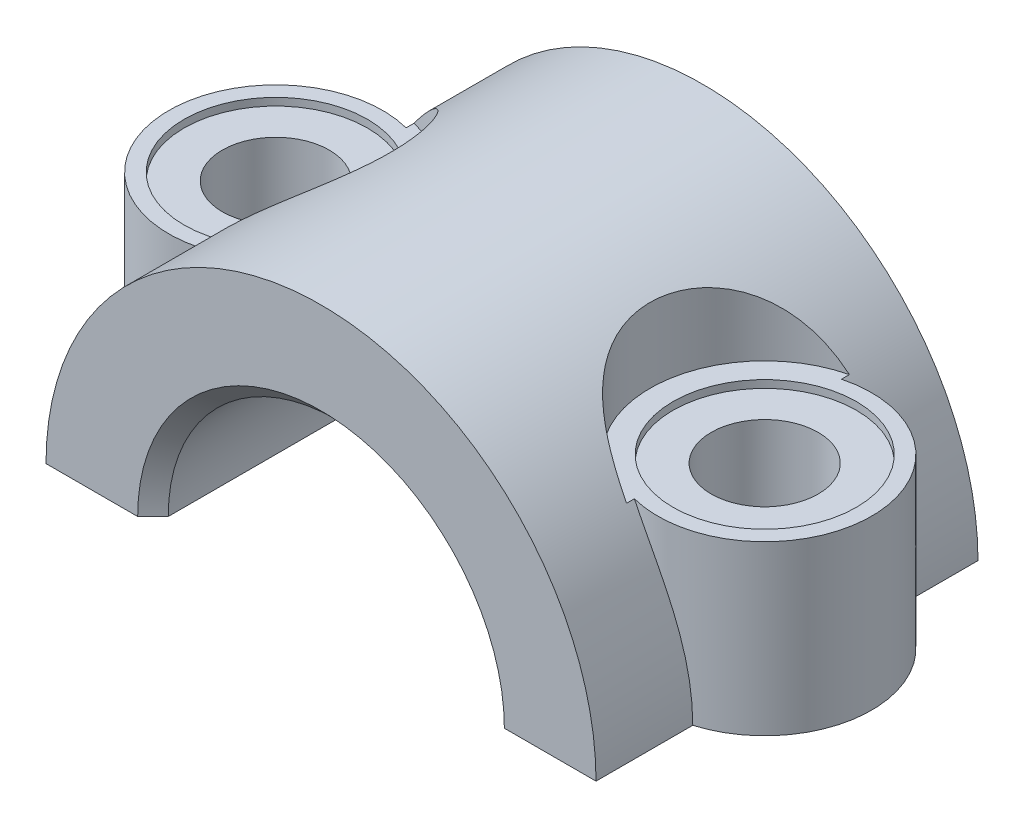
ISO-10303-21;
HEADER;
FILE_DESCRIPTION(('STEP AP214'),'2;1');
FILE_NAME('part.step','',(''),(''),'','','');
FILE_SCHEMA(('AUTOMOTIVE_DESIGN { 1 0 10303 214 1 1 1 1 }'));
ENDSEC;
DATA;
#1=APPLICATION_CONTEXT('core data for automotive mechanical design processes');
#2=APPLICATION_PROTOCOL_DEFINITION('international standard','automotive_design',2000,#1);
#3=PRODUCT_CONTEXT('',#1,'mechanical');
#4=PRODUCT('Part','Part','',(#3));
#5=PRODUCT_RELATED_PRODUCT_CATEGORY('part','',(#4));
#6=PRODUCT_DEFINITION_FORMATION('','',#4);
#7=PRODUCT_DEFINITION_CONTEXT('part definition',#1,'design');
#8=PRODUCT_DEFINITION('design','',#6,#7);
#9=PRODUCT_DEFINITION_SHAPE('','',#8);
#10=(LENGTH_UNIT() NAMED_UNIT(*) SI_UNIT(.MILLI.,.METRE.));
#11=(NAMED_UNIT(*) PLANE_ANGLE_UNIT() SI_UNIT($,.RADIAN.));
#12=(NAMED_UNIT(*) SI_UNIT($,.STERADIAN.) SOLID_ANGLE_UNIT());
#13=UNCERTAINTY_MEASURE_WITH_UNIT(LENGTH_MEASURE(1.E-05),#10,'distance_accuracy_value','');
#14=(GEOMETRIC_REPRESENTATION_CONTEXT(3) GLOBAL_UNCERTAINTY_ASSIGNED_CONTEXT((#13)) GLOBAL_UNIT_ASSIGNED_CONTEXT((#10,
#11,#12)) REPRESENTATION_CONTEXT('',''));
#15=CARTESIAN_POINT('',(0.,0.,0.));
#16=DIRECTION('',(0.,0.,1.));
#17=DIRECTION('',(1.,0.,0.));
#18=AXIS2_PLACEMENT_3D('',#15,#16,#17);
#19=CARTESIAN_POINT('',(-57.15,0.,79.375));
#20=DIRECTION('',(0.,1.,0.));
#21=DIRECTION('',(0.,0.,1.));
#22=AXIS2_PLACEMENT_3D('',#19,#20,#21);
#23=PLANE('',#22);
#24=CARTESIAN_POINT('',(-50.8,0.,37.973));
#25=DIRECTION('',(0.,-1.,0.));
#26=DIRECTION('',(0.,0.,-1.));
#27=AXIS2_PLACEMENT_3D('',#24,#25,#26);
#28=CIRCLE('',#27,11.1125);
#29=CARTESIAN_POINT('',(-50.8,0.,26.8605));
#30=VERTEX_POINT('',#29);
#31=EDGE_CURVE('E141',#30,#30,#28,.T.);
#32=ORIENTED_EDGE('',*,*,#31,.F.);
#33=EDGE_LOOP('',(#32));
#34=FACE_BOUND('',#33,.T.);
#35=DIRECTION('',(1.,0.,0.));
#36=VECTOR('',#35,1.);
#37=CARTESIAN_POINT('',(-57.15,0.,0.));
#38=LINE('',#37,#36);
#39=CARTESIAN_POINT('',(-57.15,0.,0.));
#40=VERTEX_POINT('',#39);
#41=CARTESIAN_POINT('',(-38.0999999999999,0.,0.));
#42=VERTEX_POINT('',#41);
#43=EDGE_CURVE('E248',#40,#42,#38,.T.);
#44=ORIENTED_EDGE('',*,*,#43,.T.);
#45=DIRECTION('',(0.707106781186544,0.,0.707106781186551));
#46=VECTOR('',#45,1.);
#47=CARTESIAN_POINT('',(0.,0.,38.1000000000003));
#48=LINE('',#47,#46);
#49=CARTESIAN_POINT('',(-34.925,0.,3.17499999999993));
#50=VERTEX_POINT('',#49);
#51=EDGE_CURVE('E250',#42,#50,#48,.T.);
#52=ORIENTED_EDGE('',*,*,#51,.T.);
#53=DIRECTION('',(0.,0.,1.));
#54=VECTOR('',#53,1.);
#55=CARTESIAN_POINT('',(-34.925,0.,0.));
#56=LINE('',#55,#54);
#57=CARTESIAN_POINT('',(-34.925,0.,76.2));
#58=VERTEX_POINT('',#57);
#59=EDGE_CURVE('E289',#50,#58,#56,.T.);
#60=ORIENTED_EDGE('',*,*,#59,.T.);
#61=DIRECTION('',(-0.707106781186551,0.,0.707106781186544));
#62=VECTOR('',#61,1.);
#63=CARTESIAN_POINT('',(0.,0.,41.2750000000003));
#64=LINE('',#63,#62);
#65=CARTESIAN_POINT('',(-38.1000000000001,0.,79.375));
#66=VERTEX_POINT('',#65);
#67=EDGE_CURVE('E149',#58,#66,#64,.T.);
#68=ORIENTED_EDGE('',*,*,#67,.T.);
#69=DIRECTION('',(1.,0.,0.));
#70=VECTOR('',#69,1.);
#71=CARTESIAN_POINT('',(-57.15,0.,79.375));
#72=LINE('',#71,#70);
#73=CARTESIAN_POINT('',(-57.15,0.,79.375));
#74=VERTEX_POINT('',#73);
#75=EDGE_CURVE('E269',#74,#66,#72,.T.);
#76=ORIENTED_EDGE('',*,*,#75,.F.);
#77=DIRECTION('',(0.,0.,-1.));
#78=VECTOR('',#77,1.);
#79=CARTESIAN_POINT('',(-57.15,0.,79.375));
#80=LINE('',#79,#78);
#81=CARTESIAN_POINT('',(-57.15,0.,59.2715474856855));
#82=VERTEX_POINT('',#81);
#83=EDGE_CURVE('E151',#74,#82,#80,.T.);
#84=ORIENTED_EDGE('',*,*,#83,.T.);
#85=CARTESIAN_POINT('',(-50.8,0.,37.973));
#86=DIRECTION('',(0.,-1.,0.));
#87=DIRECTION('',(0.,0.,-1.));
#88=AXIS2_PLACEMENT_3D('',#85,#86,#87);
#89=CIRCLE('',#88,22.225);
#90=CARTESIAN_POINT('',(-57.15,0.,16.6744525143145));
#91=VERTEX_POINT('',#90);
#92=EDGE_CURVE('E204',#82,#91,#89,.T.);
#93=ORIENTED_EDGE('',*,*,#92,.T.);
#94=EDGE_CURVE('E252',#91,#40,#80,.T.);
#95=ORIENTED_EDGE('',*,*,#94,.T.);
#96=EDGE_LOOP('',(#44,#52,#60,#68,#76,#84,#93,#95));
#97=FACE_BOUND('',#96,.T.);
#98=ADVANCED_FACE('F35',(#34,#97),#23,.F.);
#99=CARTESIAN_POINT('',(50.8,0.,37.973));
#100=DIRECTION('',(0.,-1.,0.));
#101=DIRECTION('',(0.,0.,-1.));
#102=AXIS2_PLACEMENT_3D('',#99,#100,#101);
#103=CYLINDRICAL_SURFACE('',#102,11.1125);
#104=CARTESIAN_POINT('',(50.8,0.,37.973));
#105=DIRECTION('',(0.,-1.,0.));
#106=DIRECTION('',(0.,0.,-1.));
#107=AXIS2_PLACEMENT_3D('',#104,#105,#106);
#108=CIRCLE('',#107,11.1125);
#109=CARTESIAN_POINT('',(50.8,0.,26.8605));
#110=VERTEX_POINT('',#109);
#111=EDGE_CURVE('E306',#110,#110,#108,.T.);
#112=ORIENTED_EDGE('',*,*,#111,.T.);
#113=EDGE_LOOP('',(#112));
#114=FACE_BOUND('',#113,.T.);
#115=CARTESIAN_POINT('',(50.8,33.3502,37.973));
#116=DIRECTION('',(0.,1.,0.));
#117=DIRECTION('',(0.,0.,1.));
#118=AXIS2_PLACEMENT_3D('',#115,#116,#117);
#119=CIRCLE('',#118,11.1125);
#120=CARTESIAN_POINT('',(50.8,33.3502,49.0855));
#121=VERTEX_POINT('',#120);
#122=EDGE_CURVE('E297',#121,#121,#119,.F.);
#123=ORIENTED_EDGE('',*,*,#122,.F.);
#124=EDGE_LOOP('',(#123));
#125=FACE_BOUND('',#124,.T.);
#126=ADVANCED_FACE('F237',(#114,#125),#103,.F.);
#127=CARTESIAN_POINT('',(-50.8,0.,37.973));
#128=DIRECTION('',(0.,-1.,0.));
#129=DIRECTION('',(0.,0.,-1.));
#130=AXIS2_PLACEMENT_3D('',#127,#128,#129);
#131=CYLINDRICAL_SURFACE('',#130,11.1125);
#132=ORIENTED_EDGE('',*,*,#31,.T.);
#133=EDGE_LOOP('',(#132));
#134=FACE_BOUND('',#133,.T.);
#135=CARTESIAN_POINT('',(-50.8,33.3502,37.973));
#136=DIRECTION('',(0.,1.,0.));
#137=DIRECTION('',(0.,0.,1.));
#138=AXIS2_PLACEMENT_3D('',#135,#136,#137);
#139=CIRCLE('',#138,11.1125);
#140=CARTESIAN_POINT('',(-50.8,33.3502,49.0855));
#141=VERTEX_POINT('',#140);
#142=EDGE_CURVE('E164',#141,#141,#139,.F.);
#143=ORIENTED_EDGE('',*,*,#142,.F.);
#144=EDGE_LOOP('',(#143));
#145=FACE_BOUND('',#144,.T.);
#146=ADVANCED_FACE('F173',(#134,#145),#131,.F.);
#147=CARTESIAN_POINT('',(0.,0.,79.375));
#148=DIRECTION('',(0.,0.,-1.));
#149=DIRECTION('',(-1.,0.,0.));
#150=AXIS2_PLACEMENT_3D('',#147,#148,#149);
#151=CYLINDRICAL_SURFACE('',#150,57.15);
#152=DIRECTION('',(0.,0.,-1.));
#153=VECTOR('',#152,1.);
#154=CARTESIAN_POINT('',(-45.2367867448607,34.925,79.375));
#155=LINE('',#154,#153);
#156=CARTESIAN_POINT('',(-45.2367867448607,34.925,14.8064117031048));
#157=VERTEX_POINT('',#156);
#158=CARTESIAN_POINT('',(-45.2367867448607,34.925,16.4555353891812));
#159=VERTEX_POINT('',#158);
#160=EDGE_CURVE('E136',#157,#159,#155,.F.);
#161=ORIENTED_EDGE('',*,*,#160,.F.);
#162=CARTESIAN_POINT('',(-45.2367867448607,34.925,61.1395882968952));
#163=CARTESIAN_POINT('',(-44.9313011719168,35.3207090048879,61.0662218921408));
#164=CARTESIAN_POINT('',(-44.6212395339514,35.7115582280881,60.9853791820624));
#165=CARTESIAN_POINT('',(-43.9928141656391,36.4828978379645,60.8073853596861));
#166=CARTESIAN_POINT('',(-43.6744482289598,36.8633854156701,60.7102298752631));
#167=CARTESIAN_POINT('',(-43.0294723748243,37.6142632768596,60.4979777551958));
#168=CARTESIAN_POINT('',(-42.7028407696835,37.9846201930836,60.382828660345));
#169=CARTESIAN_POINT('',(-42.0434348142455,38.7132205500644,60.1334820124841));
#170=CARTESIAN_POINT('',(-41.7106609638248,39.0714649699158,59.9992860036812));
#171=CARTESIAN_POINT('',(-41.0382934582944,39.7771276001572,59.7096972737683));
#172=CARTESIAN_POINT('',(-40.6986710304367,40.1244688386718,59.554183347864));
#173=CARTESIAN_POINT('',(-40.0161388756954,40.8051886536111,59.2213561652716));
#174=CARTESIAN_POINT('',(-39.6732293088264,41.1385679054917,59.0440439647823));
#175=CARTESIAN_POINT('',(-38.9863409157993,41.7900882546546,58.6667414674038));
#176=CARTESIAN_POINT('',(-38.6423640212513,42.1082483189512,58.4667805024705));
#177=CARTESIAN_POINT('',(-37.9549871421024,42.7288649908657,58.0430971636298));
#178=CARTESIAN_POINT('',(-37.6115870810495,43.0313238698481,57.8193782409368));
#179=CARTESIAN_POINT('',(-36.8236033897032,43.7091571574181,57.2756907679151));
#180=CARTESIAN_POINT('',(-36.3799556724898,44.078787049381,56.947122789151));
#181=CARTESIAN_POINT('',(-35.5027137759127,44.7883712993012,56.2472447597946));
#182=CARTESIAN_POINT('',(-35.0691195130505,45.1283259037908,55.8759350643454));
#183=CARTESIAN_POINT('',(-34.2192790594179,45.7760624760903,55.0917873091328));
#184=CARTESIAN_POINT('',(-33.8029770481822,46.0839537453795,54.6791004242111));
#185=CARTESIAN_POINT('',(-32.9921001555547,46.6679069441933,53.8119140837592));
#186=CARTESIAN_POINT('',(-32.597525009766,46.9439692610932,53.3574151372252));
#187=CARTESIAN_POINT('',(-31.8337767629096,47.4652324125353,52.4055012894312));
#188=CARTESIAN_POINT('',(-31.464771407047,47.7102368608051,51.907843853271));
#189=CARTESIAN_POINT('',(-30.7606483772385,48.1672220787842,50.8747552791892));
#190=CARTESIAN_POINT('',(-30.4255316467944,48.379201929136,50.3393230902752));
#191=CARTESIAN_POINT('',(-29.7942930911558,48.7704903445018,49.2338163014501));
#192=CARTESIAN_POINT('',(-29.4982098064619,48.9497666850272,48.663708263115));
#193=CARTESIAN_POINT('',(-28.9502291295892,49.2758409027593,47.4937587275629));
#194=CARTESIAN_POINT('',(-28.6983284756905,49.4226411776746,46.8939194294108));
#195=CARTESIAN_POINT('',(-28.2614303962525,49.6736571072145,45.7197841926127));
#196=CARTESIAN_POINT('',(-28.0726394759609,49.7803784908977,45.1474304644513));
#197=CARTESIAN_POINT('',(-27.738168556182,49.9675222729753,43.9860832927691));
#198=CARTESIAN_POINT('',(-27.5924861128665,50.0479461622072,43.3970907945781));
#199=CARTESIAN_POINT('',(-27.3461823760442,50.1829507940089,42.2071058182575));
#200=CARTESIAN_POINT('',(-27.2455427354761,50.237542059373,41.6061183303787));
#201=CARTESIAN_POINT('',(-27.0905323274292,50.3213011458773,40.3964499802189));
#202=CARTESIAN_POINT('',(-27.0361612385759,50.3504691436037,39.7877691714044));
#203=CARTESIAN_POINT('',(-26.9753138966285,50.3830930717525,38.5858348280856));
#204=CARTESIAN_POINT('',(-26.9674378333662,50.3873005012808,37.9926719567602));
#205=CARTESIAN_POINT('',(-26.9959353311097,50.3720383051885,36.807726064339));
#206=CARTESIAN_POINT('',(-27.0323077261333,50.3525693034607,36.2159430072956));
#207=CARTESIAN_POINT('',(-27.1488621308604,50.2898215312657,35.0380245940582));
#208=CARTESIAN_POINT('',(-27.2290410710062,50.2465444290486,34.4518888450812));
#209=CARTESIAN_POINT('',(-27.4322402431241,50.1358958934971,33.2893985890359));
#210=CARTESIAN_POINT('',(-27.5552606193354,50.0685243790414,32.7130441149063));
#211=CARTESIAN_POINT('',(-27.8422114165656,49.9095236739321,31.5758965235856));
#212=CARTESIAN_POINT('',(-28.0060186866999,49.8179674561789,31.0150621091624));
#213=CARTESIAN_POINT('',(-28.3727059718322,49.6100437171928,29.9110551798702));
#214=CARTESIAN_POINT('',(-28.5755856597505,49.4936764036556,29.3678825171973));
#215=CARTESIAN_POINT('',(-29.0178876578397,49.2356598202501,28.3028273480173));
#216=CARTESIAN_POINT('',(-29.2573110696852,49.0940097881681,27.78094548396));
#217=CARTESIAN_POINT('',(-29.7696649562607,48.7850283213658,26.7618246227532));
#218=CARTESIAN_POINT('',(-30.0425957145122,48.6176966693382,26.2645858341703));
#219=CARTESIAN_POINT('',(-30.6222380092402,48.2547347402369,25.2913990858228));
#220=CARTESIAN_POINT('',(-30.9293428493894,48.0587646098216,24.8158122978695));
#221=CARTESIAN_POINT('',(-31.5703707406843,47.6401162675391,23.8954998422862));
#222=CARTESIAN_POINT('',(-31.9042938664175,47.4174379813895,23.4507742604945));
#223=CARTESIAN_POINT('',(-32.5945022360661,46.9456655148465,22.594368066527));
#224=CARTESIAN_POINT('',(-32.9507758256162,46.6965850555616,22.1826704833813));
#225=CARTESIAN_POINT('',(-33.6814217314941,46.1723561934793,21.3933833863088));
#226=CARTESIAN_POINT('',(-34.0557944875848,45.8972071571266,21.0157947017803));
#227=CARTESIAN_POINT('',(-34.8393288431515,45.3056034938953,20.2754436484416));
#228=CARTESIAN_POINT('',(-35.2492689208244,44.9877053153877,19.9146599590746));
#229=CARTESIAN_POINT('',(-36.0793254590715,44.3247889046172,19.2318478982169));
#230=CARTESIAN_POINT('',(-36.4994424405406,43.9797692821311,18.9098215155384));
#231=CARTESIAN_POINT('',(-37.3460569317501,43.2631801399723,18.3031394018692));
#232=CARTESIAN_POINT('',(-37.7725667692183,42.8915520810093,18.0185702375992));
#233=CARTESIAN_POINT('',(-38.6266556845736,42.1240277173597,17.4863438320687));
#234=CARTESIAN_POINT('',(-39.0542347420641,41.7281318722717,17.2386858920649));
#235=CARTESIAN_POINT('',(-39.981819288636,40.8418559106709,16.7378459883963));
#236=CARTESIAN_POINT('',(-40.481301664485,40.3471244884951,16.4913898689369));
#237=CARTESIAN_POINT('',(-41.471244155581,39.3289085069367,16.0433424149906));
#238=CARTESIAN_POINT('',(-41.9617005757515,38.8054125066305,15.8417690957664));
#239=CARTESIAN_POINT('',(-42.9264905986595,37.7353283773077,15.4805144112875));
#240=CARTESIAN_POINT('',(-43.4008966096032,37.188879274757,15.3206140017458));
#241=CARTESIAN_POINT('',(-44.0996002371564,36.3521638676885,15.1080924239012));
#242=CARTESIAN_POINT('',(-44.3302543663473,36.0705428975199,15.0418293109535));
#243=CARTESIAN_POINT('',(-44.7870071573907,35.5018239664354,14.9178481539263));
#244=CARTESIAN_POINT('',(-45.0131062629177,35.2147265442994,14.8601292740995));
#245=CARTESIAN_POINT('',(-45.2367867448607,34.925,14.8064117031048));
#246=B_SPLINE_CURVE_WITH_KNOTS('',3,(#162,#163,#164,#165,#166,#167,#168,#169,#170,#171,#172,
#173,#174,#175,#176,#177,#178,#179,#180,#181,#182,#183,#184,#185,#186,#187,#188,#189,#190,#191,
#192,#193,#194,#195,#196,#197,#198,#199,#200,#201,#202,#203,#204,#205,#206,#207,#208,#209,#210,
#211,#212,#213,#214,#215,#216,#217,#218,#219,#220,#221,#222,#223,#224,#225,#226,#227,#228,#229,
#230,#231,#232,#233,#234,#235,#236,#237,#238,#239,#240,#241,#242,#243,#244,#245),.UNSPECIFIED.,
.F.,.F.,(4,2,2,2,2,2,2,2,2,2,2,2,2,2,2,2,2,2,2,2,2,2,2,2,2,2,2,2,2,2,2,2,2,2,2,2,2,2,2,2,2,4),
(0.,1.51575579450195,3.0319184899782,4.55258689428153,6.07313208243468,7.60271173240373,
9.1322172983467,10.6597642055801,12.1870895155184,14.1781541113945,16.1692021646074,
18.1532239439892,20.1372215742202,22.1331974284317,24.1292288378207,26.1272165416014,
28.1250566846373,29.9589794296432,31.7927981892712,33.6258693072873,35.458927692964,
37.2365054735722,39.014036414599,40.7914428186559,42.5688552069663,44.3409646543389,
46.1130592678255,47.8852073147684,49.6573703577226,51.4525900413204,53.247814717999,
55.0421109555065,56.8364508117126,58.7301470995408,60.6239405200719,62.5220365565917,
64.4200966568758,66.6528335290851,68.8864649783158,71.1081076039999,72.2179771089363,
73.3277379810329),.UNSPECIFIED.);
#247=CARTESIAN_POINT('',(-45.2367867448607,34.925,61.1395882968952));
#248=VERTEX_POINT('',#247);
#249=EDGE_CURVE('E140',#248,#157,#246,.T.);
#250=ORIENTED_EDGE('',*,*,#249,.F.);
#251=CARTESIAN_POINT('',(-45.2367867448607,34.925,59.4904646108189));
#252=VERTEX_POINT('',#251);
#253=EDGE_CURVE('E125',#252,#248,#155,.F.);
#254=ORIENTED_EDGE('',*,*,#253,.F.);
#255=CARTESIAN_POINT('',(-45.2367867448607,34.925,59.4904646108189));
#256=CARTESIAN_POINT('',(-45.610002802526,34.4416331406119,59.5869290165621));
#257=CARTESIAN_POINT('',(-45.9765277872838,33.9508309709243,59.6713627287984));
#258=CARTESIAN_POINT('',(-46.6949557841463,32.9557167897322,59.8186850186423));
#259=CARTESIAN_POINT('',(-47.0468636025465,32.4514093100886,59.8815807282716));
#260=CARTESIAN_POINT('',(-47.7344313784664,31.4312653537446,59.9883052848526));
#261=CARTESIAN_POINT('',(-48.0701201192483,30.9154518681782,60.0321691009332));
#262=CARTESIAN_POINT('',(-48.7251516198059,29.8724200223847,60.1033894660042));
#263=CARTESIAN_POINT('',(-49.0444929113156,29.3452006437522,60.1307445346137));
#264=CARTESIAN_POINT('',(-49.9764045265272,27.7488414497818,60.1914630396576));
#265=CARTESIAN_POINT('',(-50.5635879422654,26.6639246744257,60.2035821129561));
#266=CARTESIAN_POINT('',(-51.6666422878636,24.458184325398,60.1879498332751));
#267=CARTESIAN_POINT('',(-52.1824701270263,23.3373395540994,60.1601745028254));
#268=CARTESIAN_POINT('',(-52.9727297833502,21.4628783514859,60.0937431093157));
#269=CARTESIAN_POINT('',(-53.2684988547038,20.7179044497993,60.0622882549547));
#270=CARTESIAN_POINT('',(-53.8283784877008,19.2164023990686,59.9925185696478));
#271=CARTESIAN_POINT('',(-54.0924873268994,18.4598736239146,59.9542033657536));
#272=CARTESIAN_POINT('',(-54.5886654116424,16.9364120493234,59.874136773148));
#273=CARTESIAN_POINT('',(-54.8207284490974,16.1694772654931,59.8323847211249));
#274=CARTESIAN_POINT('',(-55.2524006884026,14.626565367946,59.7485620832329));
#275=CARTESIAN_POINT('',(-55.4520107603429,13.8505884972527,59.7064915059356));
#276=CARTESIAN_POINT('',(-55.818205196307,12.2918873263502,59.6248680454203));
#277=CARTESIAN_POINT('',(-55.9848349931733,11.5091738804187,59.5853117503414));
#278=CARTESIAN_POINT('',(-56.2851258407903,9.93717532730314,59.511058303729));
#279=CARTESIAN_POINT('',(-56.4187854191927,9.14788992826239,59.4763613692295));
#280=CARTESIAN_POINT('',(-56.6527922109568,7.56463030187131,59.4138513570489));
#281=CARTESIAN_POINT('',(-56.7531600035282,6.77065928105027,59.3860340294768));
#282=CARTESIAN_POINT('',(-56.9204718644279,5.17904439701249,59.3388148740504));
#283=CARTESIAN_POINT('',(-56.9874214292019,4.38140115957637,59.3194116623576));
#284=CARTESIAN_POINT('',(-57.0563295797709,3.28437615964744,59.2992585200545));
#285=CARTESIAN_POINT('',(-57.0727268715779,2.98591797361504,59.2944381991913));
#286=CARTESIAN_POINT('',(-57.1008358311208,2.38879874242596,59.2861489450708));
#287=CARTESIAN_POINT('',(-57.1125481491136,2.09013773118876,59.2826798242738));
#288=CARTESIAN_POINT('',(-57.1312763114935,1.49295767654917,59.2771231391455));
#289=CARTESIAN_POINT('',(-57.1382968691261,1.19443879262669,59.2750341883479));
#290=CARTESIAN_POINT('',(-57.1476591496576,0.597280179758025,59.2722453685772));
#291=CARTESIAN_POINT('',(-57.1500002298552,0.298640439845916,59.2715456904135));
#292=CARTESIAN_POINT('',(-57.15,0.,59.2715474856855));
#293=B_SPLINE_CURVE_WITH_KNOTS('',3,(#255,#256,#257,#258,#259,#260,#261,#262,#263,#264,#265,
#266,#267,#268,#269,#270,#271,#272,#273,#274,#275,#276,#277,#278,#279,#280,#281,#282,#283,#284,
#285,#286,#287,#288,#289,#290,#291,#292),.UNSPECIFIED.,.F.,.F.,(4,2,2,2,2,2,2,2,2,2,2,2,2,2,2,2,
2,2,4),(0.,1.85441641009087,3.70821815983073,5.5585991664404,7.40914607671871,11.1063467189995,
14.8057703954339,17.2115582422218,19.6174769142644,22.0238610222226,24.4301806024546,
26.8331618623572,29.2362504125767,31.6378507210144,34.039055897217,34.9358694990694,
35.8325585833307,36.7283455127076,37.6242554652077),.UNSPECIFIED.);
#294=EDGE_CURVE('E206',#252,#82,#293,.T.);
#295=ORIENTED_EDGE('',*,*,#294,.T.);
#296=ORIENTED_EDGE('',*,*,#83,.F.);
#297=CARTESIAN_POINT('',(0.,0.,79.375));
#298=DIRECTION('',(0.,0.,1.));
#299=DIRECTION('',(1.,0.,0.));
#300=AXIS2_PLACEMENT_3D('',#297,#298,#299);
#301=CIRCLE('',#300,57.15);
#302=CARTESIAN_POINT('',(57.15,0.,79.375));
#303=VERTEX_POINT('',#302);
#304=EDGE_CURVE('E255',#303,#74,#301,.T.);
#305=ORIENTED_EDGE('',*,*,#304,.F.);
#306=DIRECTION('',(0.,0.,-1.));
#307=VECTOR('',#306,1.);
#308=CARTESIAN_POINT('',(57.15,0.,79.375));
#309=LINE('',#308,#307);
#310=CARTESIAN_POINT('',(57.15,0.,59.2715474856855));
#311=VERTEX_POINT('',#310);
#312=EDGE_CURVE('E264',#303,#311,#309,.T.);
#313=ORIENTED_EDGE('',*,*,#312,.T.);
#314=CARTESIAN_POINT('',(57.15,0.,59.2715474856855));
#315=CARTESIAN_POINT('',(57.1500000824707,0.396081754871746,59.2715433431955));
#316=CARTESIAN_POINT('',(57.1458822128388,0.792150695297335,59.2727757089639));
#317=CARTESIAN_POINT('',(57.1294144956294,1.58409891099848,59.2776765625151));
#318=CARTESIAN_POINT('',(57.117064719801,1.97997818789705,59.2813450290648));
#319=CARTESIAN_POINT('',(57.0676766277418,3.16701620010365,59.2959482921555));
#320=CARTESIAN_POINT('',(57.0182995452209,3.95765488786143,59.3104809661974));
#321=CARTESIAN_POINT('',(56.8868034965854,5.53536893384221,59.3483618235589));
#322=CARTESIAN_POINT('',(56.8047088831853,6.3224465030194,59.3717034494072));
#323=CARTESIAN_POINT('',(56.6079533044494,7.89226613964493,59.4259419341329));
#324=CARTESIAN_POINT('',(56.4932921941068,8.67500818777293,59.456838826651));
#325=CARTESIAN_POINT('',(56.2352045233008,10.2135198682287,59.523555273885));
#326=CARTESIAN_POINT('',(56.0926483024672,10.9694426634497,59.5592174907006));
#327=CARTESIAN_POINT('',(55.7771859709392,12.4747502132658,59.6341292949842));
#328=CARTESIAN_POINT('',(55.6042797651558,13.2241349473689,59.6733788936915));
#329=CARTESIAN_POINT('',(55.2283228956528,14.7155176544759,59.7532092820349));
#330=CARTESIAN_POINT('',(55.0252614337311,15.4575128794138,59.7937905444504));
#331=CARTESIAN_POINT('',(54.5893337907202,16.9327713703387,59.8737003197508));
#332=CARTESIAN_POINT('',(54.3564673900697,17.6660345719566,59.9130288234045));
#333=CARTESIAN_POINT('',(53.8595235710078,19.1278416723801,59.9878476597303));
#334=CARTESIAN_POINT('',(53.595239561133,19.8563168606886,60.0233092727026));
#335=CARTESIAN_POINT('',(53.0371513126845,21.3021964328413,60.0869018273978));
#336=CARTESIAN_POINT('',(52.7433474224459,22.0196009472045,60.1150328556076));
#337=CARTESIAN_POINT('',(52.1268824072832,23.4416451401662,60.1605069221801));
#338=CARTESIAN_POINT('',(51.8042425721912,24.1462937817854,60.1778578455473));
#339=CARTESIAN_POINT('',(51.1304578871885,25.5421097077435,60.198099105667));
#340=CARTESIAN_POINT('',(50.7793115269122,26.2332762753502,60.2009886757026));
#341=CARTESIAN_POINT('',(50.0387817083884,27.6202525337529,60.1881348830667));
#342=CARTESIAN_POINT('',(49.6485908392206,28.3156276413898,60.1718551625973));
#343=CARTESIAN_POINT('',(48.8399660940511,29.6886321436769,60.115112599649));
#344=CARTESIAN_POINT('',(48.4215367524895,30.36626436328,60.0746536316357));
#345=CARTESIAN_POINT('',(47.556557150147,31.703820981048,59.9643920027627));
#346=CARTESIAN_POINT('',(47.109929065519,32.3636885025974,59.8945048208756));
#347=CARTESIAN_POINT('',(46.4212227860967,33.3369282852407,59.7636301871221));
#348=CARTESIAN_POINT('',(46.1884415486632,33.6586914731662,59.7156432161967));
#349=CARTESIAN_POINT('',(45.7169649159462,34.2963397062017,59.6102755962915));
#350=CARTESIAN_POINT('',(45.4782689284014,34.6122241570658,59.5528940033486));
#351=CARTESIAN_POINT('',(45.2367867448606,34.925,59.4904646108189));
#352=B_SPLINE_CURVE_WITH_KNOTS('',3,(#314,#315,#316,#317,#318,#319,#320,#321,#322,#323,#324,
#325,#326,#327,#328,#329,#330,#331,#332,#333,#334,#335,#336,#337,#338,#339,#340,#341,#342,#343,
#344,#345,#346,#347,#348,#349,#350,#351),.UNSPECIFIED.,.F.,.F.,(4,2,2,2,2,2,2,2,2,2,2,2,2,2,2,2,
2,2,4),(0.,1.18819642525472,2.37638249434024,4.75251552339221,7.12688321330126,9.50126147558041,
11.8108472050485,14.1204401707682,16.4308621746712,18.7413011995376,21.0678740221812,
23.3944193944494,25.7192610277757,28.0442259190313,30.4358199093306,32.8270307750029,
35.2251568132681,36.4250636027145,37.6250910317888),.UNSPECIFIED.);
#353=CARTESIAN_POINT('',(45.2367867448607,34.925,59.4904646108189));
#354=VERTEX_POINT('',#353);
#355=EDGE_CURVE('E198',#311,#354,#352,.T.);
#356=ORIENTED_EDGE('',*,*,#355,.T.);
#357=DIRECTION('',(0.,0.,-1.));
#358=VECTOR('',#357,1.);
#359=CARTESIAN_POINT('',(45.2367867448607,34.925,79.375));
#360=LINE('',#359,#358);
#361=CARTESIAN_POINT('',(45.2367867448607,34.925,61.1395882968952));
#362=VERTEX_POINT('',#361);
#363=EDGE_CURVE('E315',#362,#354,#360,.T.);
#364=ORIENTED_EDGE('',*,*,#363,.F.);
#365=CARTESIAN_POINT('',(45.2367867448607,34.925,14.8064117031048));
#366=CARTESIAN_POINT('',(44.9313011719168,35.3207090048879,14.8797781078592));
#367=CARTESIAN_POINT('',(44.6212395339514,35.7115582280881,14.9606208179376));
#368=CARTESIAN_POINT('',(43.9928141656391,36.4828978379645,15.1386146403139));
#369=CARTESIAN_POINT('',(43.6744482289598,36.8633854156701,15.2357701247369));
#370=CARTESIAN_POINT('',(43.0294723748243,37.6142632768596,15.4480222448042));
#371=CARTESIAN_POINT('',(42.7028407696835,37.9846201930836,15.563171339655));
#372=CARTESIAN_POINT('',(42.0434348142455,38.7132205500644,15.8125179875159));
#373=CARTESIAN_POINT('',(41.7106609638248,39.0714649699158,15.9467139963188));
#374=CARTESIAN_POINT('',(41.0382934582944,39.7771276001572,16.2363027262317));
#375=CARTESIAN_POINT('',(40.6986710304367,40.1244688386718,16.391816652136));
#376=CARTESIAN_POINT('',(40.0161388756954,40.8051886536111,16.7246438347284));
#377=CARTESIAN_POINT('',(39.6732293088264,41.1385679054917,16.9019560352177));
#378=CARTESIAN_POINT('',(38.9863409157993,41.7900882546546,17.2792585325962));
#379=CARTESIAN_POINT('',(38.6423640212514,42.1082483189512,17.4792194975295));
#380=CARTESIAN_POINT('',(37.9549871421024,42.7288649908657,17.9029028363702));
#381=CARTESIAN_POINT('',(37.6115870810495,43.0313238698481,18.1266217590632));
#382=CARTESIAN_POINT('',(36.8236033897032,43.7091571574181,18.6703092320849));
#383=CARTESIAN_POINT('',(36.3799556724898,44.078787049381,18.998877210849));
#384=CARTESIAN_POINT('',(35.5027137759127,44.7883712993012,19.6987552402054));
#385=CARTESIAN_POINT('',(35.0691195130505,45.1283259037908,20.0700649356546));
#386=CARTESIAN_POINT('',(34.2192790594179,45.7760624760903,20.8542126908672));
#387=CARTESIAN_POINT('',(33.8029770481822,46.0839537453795,21.2668995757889));
#388=CARTESIAN_POINT('',(32.9921001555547,46.6679069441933,22.1340859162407));
#389=CARTESIAN_POINT('',(32.597525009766,46.9439692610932,22.5885848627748));
#390=CARTESIAN_POINT('',(31.8337767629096,47.4652324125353,23.5404987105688));
#391=CARTESIAN_POINT('',(31.4647714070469,47.7102368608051,24.038156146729));
#392=CARTESIAN_POINT('',(30.7606483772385,48.1672220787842,25.0712447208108));
#393=CARTESIAN_POINT('',(30.4255316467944,48.379201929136,25.6066769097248));
#394=CARTESIAN_POINT('',(29.7942930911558,48.7704903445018,26.7121836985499));
#395=CARTESIAN_POINT('',(29.4982098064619,48.9497666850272,27.282291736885));
#396=CARTESIAN_POINT('',(28.9502291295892,49.2758409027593,28.452241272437));
#397=CARTESIAN_POINT('',(28.6983284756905,49.4226411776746,29.0520805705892));
#398=CARTESIAN_POINT('',(28.2614303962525,49.6736571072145,30.2262158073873));
#399=CARTESIAN_POINT('',(28.0726394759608,49.7803784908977,30.7985695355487));
#400=CARTESIAN_POINT('',(27.738168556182,49.9675222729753,31.9599167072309));
#401=CARTESIAN_POINT('',(27.5924861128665,50.0479461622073,32.5489092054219));
#402=CARTESIAN_POINT('',(27.3461823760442,50.1829507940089,33.7388941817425));
#403=CARTESIAN_POINT('',(27.2455427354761,50.237542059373,34.3398816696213));
#404=CARTESIAN_POINT('',(27.0905323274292,50.3213011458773,35.5495500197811));
#405=CARTESIAN_POINT('',(27.0361612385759,50.3504691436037,36.1582308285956));
#406=CARTESIAN_POINT('',(26.9753138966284,50.3830930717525,37.3601651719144));
#407=CARTESIAN_POINT('',(26.9674378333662,50.3873005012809,37.9533280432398));
#408=CARTESIAN_POINT('',(26.9959353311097,50.3720383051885,39.138273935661));
#409=CARTESIAN_POINT('',(27.0323077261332,50.3525693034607,39.7300569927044));
#410=CARTESIAN_POINT('',(27.1488621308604,50.2898215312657,40.9079754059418));
#411=CARTESIAN_POINT('',(27.2290410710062,50.2465444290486,41.4941111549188));
#412=CARTESIAN_POINT('',(27.4322402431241,50.1358958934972,42.6566014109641));
#413=CARTESIAN_POINT('',(27.5552606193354,50.0685243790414,43.2329558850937));
#414=CARTESIAN_POINT('',(27.8422114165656,49.9095236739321,44.3701034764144));
#415=CARTESIAN_POINT('',(28.0060186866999,49.8179674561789,44.9309378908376));
#416=CARTESIAN_POINT('',(28.3727059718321,49.6100437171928,46.0349448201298));
#417=CARTESIAN_POINT('',(28.5755856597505,49.4936764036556,46.5781174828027));
#418=CARTESIAN_POINT('',(29.0178876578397,49.2356598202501,47.6431726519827));
#419=CARTESIAN_POINT('',(29.2573110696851,49.0940097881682,48.16505451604));
#420=CARTESIAN_POINT('',(29.7696649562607,48.7850283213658,49.1841753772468));
#421=CARTESIAN_POINT('',(30.0425957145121,48.6176966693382,49.6814141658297));
#422=CARTESIAN_POINT('',(30.6222380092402,48.2547347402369,50.6546009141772));
#423=CARTESIAN_POINT('',(30.9293428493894,48.0587646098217,51.1301877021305));
#424=CARTESIAN_POINT('',(31.5703707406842,47.6401162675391,52.0505001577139));
#425=CARTESIAN_POINT('',(31.9042938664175,47.4174379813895,52.4952257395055));
#426=CARTESIAN_POINT('',(32.5945022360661,46.9456655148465,53.3516319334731));
#427=CARTESIAN_POINT('',(32.9507758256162,46.6965850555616,53.7633295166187));
#428=CARTESIAN_POINT('',(33.6814217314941,46.1723561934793,54.5526166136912));
#429=CARTESIAN_POINT('',(34.0557944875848,45.8972071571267,54.9302052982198));
#430=CARTESIAN_POINT('',(34.8393288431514,45.3056034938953,55.6705563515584));
#431=CARTESIAN_POINT('',(35.2492689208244,44.9877053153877,56.0313400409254));
#432=CARTESIAN_POINT('',(36.0793254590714,44.3247889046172,56.7141521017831));
#433=CARTESIAN_POINT('',(36.4994424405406,43.9797692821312,57.0361784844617));
#434=CARTESIAN_POINT('',(37.34605693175,43.2631801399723,57.6428605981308));
#435=CARTESIAN_POINT('',(37.7725667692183,42.8915520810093,57.9274297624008));
#436=CARTESIAN_POINT('',(38.6266556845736,42.1240277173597,58.4596561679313));
#437=CARTESIAN_POINT('',(39.054234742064,41.7281318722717,58.7073141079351));
#438=CARTESIAN_POINT('',(39.981819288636,40.8418559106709,59.2081540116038));
#439=CARTESIAN_POINT('',(40.4813016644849,40.3471244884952,59.4546101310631));
#440=CARTESIAN_POINT('',(41.471244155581,39.3289085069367,59.9026575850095));
#441=CARTESIAN_POINT('',(41.9617005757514,38.8054125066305,60.1042309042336));
#442=CARTESIAN_POINT('',(42.9264905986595,37.7353283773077,60.4654855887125));
#443=CARTESIAN_POINT('',(43.4008966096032,37.188879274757,60.6253859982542));
#444=CARTESIAN_POINT('',(44.0996002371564,36.3521638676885,60.8379075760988));
#445=CARTESIAN_POINT('',(44.3302543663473,36.0705428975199,60.9041706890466));
#446=CARTESIAN_POINT('',(44.7870071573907,35.5018239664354,61.0281518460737));
#447=CARTESIAN_POINT('',(45.0131062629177,35.2147265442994,61.0858707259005));
#448=CARTESIAN_POINT('',(45.2367867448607,34.925,61.1395882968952));
#449=B_SPLINE_CURVE_WITH_KNOTS('',3,(#365,#366,#367,#368,#369,#370,#371,#372,#373,#374,#375,
#376,#377,#378,#379,#380,#381,#382,#383,#384,#385,#386,#387,#388,#389,#390,#391,#392,#393,#394,
#395,#396,#397,#398,#399,#400,#401,#402,#403,#404,#405,#406,#407,#408,#409,#410,#411,#412,#413,
#414,#415,#416,#417,#418,#419,#420,#421,#422,#423,#424,#425,#426,#427,#428,#429,#430,#431,#432,
#433,#434,#435,#436,#437,#438,#439,#440,#441,#442,#443,#444,#445,#446,#447,#448),.UNSPECIFIED.,
.F.,.F.,(4,2,2,2,2,2,2,2,2,2,2,2,2,2,2,2,2,2,2,2,2,2,2,2,2,2,2,2,2,2,2,2,2,2,2,2,2,2,2,2,2,4),
(0.,1.51575579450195,3.03191848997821,4.55258689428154,6.0731320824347,7.60271173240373,
9.1322172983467,10.6597642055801,12.1870895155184,14.1781541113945,16.1692021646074,
18.1532239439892,20.1372215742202,22.1331974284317,24.1292288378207,26.1272165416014,
28.1250566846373,29.9589794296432,31.7927981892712,33.6258693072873,35.458927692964,
37.2365054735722,39.014036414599,40.7914428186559,42.5688552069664,44.3409646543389,
46.1130592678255,47.8852073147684,49.6573703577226,51.4525900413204,53.247814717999,
55.0421109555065,56.8364508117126,58.7301470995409,60.6239405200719,62.5220365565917,
64.4200966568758,66.6528335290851,68.8864649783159,71.108107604,72.2179771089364,
73.327737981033),.UNSPECIFIED.);
#450=CARTESIAN_POINT('',(45.2367867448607,34.925,14.8064117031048));
#451=VERTEX_POINT('',#450);
#452=EDGE_CURVE('E146',#451,#362,#449,.T.);
#453=ORIENTED_EDGE('',*,*,#452,.F.);
#454=CARTESIAN_POINT('',(45.2367867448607,34.925,16.4555353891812));
#455=VERTEX_POINT('',#454);
#456=EDGE_CURVE('E313',#455,#451,#360,.T.);
#457=ORIENTED_EDGE('',*,*,#456,.F.);
#458=CARTESIAN_POINT('',(45.2367867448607,34.925,16.4555353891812));
#459=CARTESIAN_POINT('',(45.610002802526,34.4416331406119,16.3590709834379));
#460=CARTESIAN_POINT('',(45.9765277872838,33.9508309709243,16.2746372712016));
#461=CARTESIAN_POINT('',(46.6949557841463,32.9557167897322,16.1273149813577));
#462=CARTESIAN_POINT('',(47.0468636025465,32.4514093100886,16.0644192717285));
#463=CARTESIAN_POINT('',(47.7344313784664,31.4312653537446,15.9576947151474));
#464=CARTESIAN_POINT('',(48.0701201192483,30.9154518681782,15.9138308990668));
#465=CARTESIAN_POINT('',(48.7251516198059,29.8724200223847,15.8426105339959));
#466=CARTESIAN_POINT('',(49.0444929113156,29.3452006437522,15.8152554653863));
#467=CARTESIAN_POINT('',(49.9764045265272,27.7488414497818,15.7545369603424));
#468=CARTESIAN_POINT('',(50.5635879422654,26.6639246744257,15.7424178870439));
#469=CARTESIAN_POINT('',(51.6666422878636,24.458184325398,15.7580501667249));
#470=CARTESIAN_POINT('',(52.1824701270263,23.3373395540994,15.7858254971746));
#471=CARTESIAN_POINT('',(52.9727297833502,21.4628783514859,15.8522568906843));
#472=CARTESIAN_POINT('',(53.2684988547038,20.7179044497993,15.8837117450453));
#473=CARTESIAN_POINT('',(53.8283784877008,19.2164023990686,15.9534814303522));
#474=CARTESIAN_POINT('',(54.0924873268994,18.4598736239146,15.9917966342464));
#475=CARTESIAN_POINT('',(54.5886654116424,16.9364120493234,16.071863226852));
#476=CARTESIAN_POINT('',(54.8207284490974,16.1694772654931,16.1136152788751));
#477=CARTESIAN_POINT('',(55.2524006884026,14.626565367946,16.1974379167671));
#478=CARTESIAN_POINT('',(55.4520107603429,13.8505884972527,16.2395084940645));
#479=CARTESIAN_POINT('',(55.818205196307,12.2918873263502,16.3211319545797));
#480=CARTESIAN_POINT('',(55.9848349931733,11.5091738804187,16.3606882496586));
#481=CARTESIAN_POINT('',(56.2851258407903,9.93717532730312,16.434941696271));
#482=CARTESIAN_POINT('',(56.4187854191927,9.14788992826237,16.4696386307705));
#483=CARTESIAN_POINT('',(56.6527922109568,7.56463030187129,16.5321486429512));
#484=CARTESIAN_POINT('',(56.7531600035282,6.77065928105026,16.5599659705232));
#485=CARTESIAN_POINT('',(56.9204718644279,5.17904439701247,16.6071851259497));
#486=CARTESIAN_POINT('',(56.9874214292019,4.38140115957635,16.6265883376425));
#487=CARTESIAN_POINT('',(57.0563295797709,3.28437615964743,16.6467414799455));
#488=CARTESIAN_POINT('',(57.0727268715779,2.98591797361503,16.6515618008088));
#489=CARTESIAN_POINT('',(57.1008358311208,2.38879874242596,16.6598510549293));
#490=CARTESIAN_POINT('',(57.1125481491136,2.09013773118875,16.6633201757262));
#491=CARTESIAN_POINT('',(57.1312763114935,1.49295767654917,16.6688768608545));
#492=CARTESIAN_POINT('',(57.1382968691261,1.19443879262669,16.6709658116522));
#493=CARTESIAN_POINT('',(57.1476591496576,0.597280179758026,16.6737546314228));
#494=CARTESIAN_POINT('',(57.1500002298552,0.298640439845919,16.6744543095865));
#495=CARTESIAN_POINT('',(57.15,0.,16.6744525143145));
#496=B_SPLINE_CURVE_WITH_KNOTS('',3,(#458,#459,#460,#461,#462,#463,#464,#465,#466,#467,#468,
#469,#470,#471,#472,#473,#474,#475,#476,#477,#478,#479,#480,#481,#482,#483,#484,#485,#486,#487,
#488,#489,#490,#491,#492,#493,#494,#495),.UNSPECIFIED.,.F.,.F.,(4,2,2,2,2,2,2,2,2,2,2,2,2,2,2,2,
2,2,4),(0.,1.85441641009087,3.70821815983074,5.5585991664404,7.40914607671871,11.1063467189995,
14.8057703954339,17.2115582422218,19.6174769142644,22.0238610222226,24.4301806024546,
26.8331618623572,29.2362504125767,31.6378507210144,34.039055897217,34.9358694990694,
35.8325585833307,36.7283455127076,37.6242554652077),.UNSPECIFIED.);
#497=CARTESIAN_POINT('',(57.15,0.,16.6744525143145));
#498=VERTEX_POINT('',#497);
#499=EDGE_CURVE('E192',#455,#498,#496,.T.);
#500=ORIENTED_EDGE('',*,*,#499,.T.);
#501=CARTESIAN_POINT('',(57.15,0.,0.));
#502=VERTEX_POINT('',#501);
#503=EDGE_CURVE('E265',#498,#502,#309,.T.);
#504=ORIENTED_EDGE('',*,*,#503,.T.);
#505=CARTESIAN_POINT('',(0.,0.,0.));
#506=DIRECTION('',(0.,0.,1.));
#507=DIRECTION('',(1.,0.,0.));
#508=AXIS2_PLACEMENT_3D('',#505,#506,#507);
#509=CIRCLE('',#508,57.15);
#510=EDGE_CURVE('E260',#502,#40,#509,.T.);
#511=ORIENTED_EDGE('',*,*,#510,.T.);
#512=ORIENTED_EDGE('',*,*,#94,.F.);
#513=CARTESIAN_POINT('',(-57.15,0.,16.6744525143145));
#514=CARTESIAN_POINT('',(-57.1500000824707,0.396081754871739,16.6744566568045));
#515=CARTESIAN_POINT('',(-57.1458822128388,0.792150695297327,16.6732242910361));
#516=CARTESIAN_POINT('',(-57.1294144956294,1.58409891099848,16.6683234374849));
#517=CARTESIAN_POINT('',(-57.117064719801,1.97997818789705,16.6646549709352));
#518=CARTESIAN_POINT('',(-57.0676766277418,3.16701620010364,16.6500517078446));
#519=CARTESIAN_POINT('',(-57.0182995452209,3.95765488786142,16.6355190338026));
#520=CARTESIAN_POINT('',(-56.8868034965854,5.5353689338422,16.5976381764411));
#521=CARTESIAN_POINT('',(-56.8047088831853,6.32244650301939,16.5742965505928));
#522=CARTESIAN_POINT('',(-56.6079533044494,7.89226613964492,16.5200580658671));
#523=CARTESIAN_POINT('',(-56.4932921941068,8.67500818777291,16.489161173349));
#524=CARTESIAN_POINT('',(-56.2352045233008,10.2135198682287,16.422444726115));
#525=CARTESIAN_POINT('',(-56.0926483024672,10.9694426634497,16.3867825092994));
#526=CARTESIAN_POINT('',(-55.7771859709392,12.4747502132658,16.3118707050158));
#527=CARTESIAN_POINT('',(-55.6042797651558,13.2241349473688,16.2726211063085));
#528=CARTESIAN_POINT('',(-55.2283228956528,14.7155176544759,16.1927907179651));
#529=CARTESIAN_POINT('',(-55.0252614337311,15.4575128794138,16.1522094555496));
#530=CARTESIAN_POINT('',(-54.5893337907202,16.9327713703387,16.0722996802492));
#531=CARTESIAN_POINT('',(-54.3564673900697,17.6660345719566,16.0329711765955));
#532=CARTESIAN_POINT('',(-53.8595235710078,19.1278416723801,15.9581523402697));
#533=CARTESIAN_POINT('',(-53.595239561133,19.8563168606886,15.9226907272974));
#534=CARTESIAN_POINT('',(-53.0371513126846,21.3021964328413,15.8590981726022));
#535=CARTESIAN_POINT('',(-52.7433474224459,22.0196009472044,15.8309671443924));
#536=CARTESIAN_POINT('',(-52.1268824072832,23.4416451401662,15.7854930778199));
#537=CARTESIAN_POINT('',(-51.8042425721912,24.1462937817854,15.7681421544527));
#538=CARTESIAN_POINT('',(-51.1304578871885,25.5421097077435,15.747900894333));
#539=CARTESIAN_POINT('',(-50.7793115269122,26.2332762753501,15.7450113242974));
#540=CARTESIAN_POINT('',(-50.0387817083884,27.6202525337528,15.7578651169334));
#541=CARTESIAN_POINT('',(-49.6485908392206,28.3156276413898,15.7741448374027));
#542=CARTESIAN_POINT('',(-48.8399660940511,29.6886321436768,15.830887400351));
#543=CARTESIAN_POINT('',(-48.4215367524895,30.36626436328,15.8713463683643));
#544=CARTESIAN_POINT('',(-47.556557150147,31.703820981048,15.9816079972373));
#545=CARTESIAN_POINT('',(-47.109929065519,32.3636885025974,16.0514951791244));
#546=CARTESIAN_POINT('',(-46.4212227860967,33.3369282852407,16.1823698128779));
#547=CARTESIAN_POINT('',(-46.1884415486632,33.6586914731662,16.2303567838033));
#548=CARTESIAN_POINT('',(-45.7169649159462,34.2963397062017,16.3357244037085));
#549=CARTESIAN_POINT('',(-45.4782689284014,34.6122241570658,16.3931059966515));
#550=CARTESIAN_POINT('',(-45.2367867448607,34.925,16.4555353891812));
#551=B_SPLINE_CURVE_WITH_KNOTS('',3,(#513,#514,#515,#516,#517,#518,#519,#520,#521,#522,#523,
#524,#525,#526,#527,#528,#529,#530,#531,#532,#533,#534,#535,#536,#537,#538,#539,#540,#541,#542,
#543,#544,#545,#546,#547,#548,#549,#550),.UNSPECIFIED.,.F.,.F.,(4,2,2,2,2,2,2,2,2,2,2,2,2,2,2,2,
2,2,4),(0.,1.18819642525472,2.37638249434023,4.75251552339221,7.12688321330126,9.5012614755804,
11.8108472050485,14.1204401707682,16.4308621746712,18.7413011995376,21.0678740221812,
23.3944193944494,25.7192610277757,28.0442259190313,30.4358199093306,32.8270307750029,
35.2251568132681,36.4250636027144,37.6250910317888),.UNSPECIFIED.);
#552=EDGE_CURVE('E212',#91,#159,#551,.T.);
#553=ORIENTED_EDGE('',*,*,#552,.T.);
#554=EDGE_LOOP('',(#161,#250,#254,#295,#296,#305,#313,#356,#364,#453,#457,#500,#504,#511,#512,#553));
#555=FACE_BOUND('',#554,.T.);
#556=ADVANCED_FACE('F143',(#555),#151,.T.);
#557=ORIENTED_EDGE('',*,*,#111,.F.);
#558=EDGE_LOOP('',(#557));
#559=FACE_BOUND('',#558,.T.);
#560=DIRECTION('',(0.,0.,1.));
#561=VECTOR('',#560,1.);
#562=CARTESIAN_POINT('',(34.925,0.,0.));
#563=LINE('',#562,#561);
#564=CARTESIAN_POINT('',(34.925,0.,76.2));
#565=VERTEX_POINT('',#564);
#566=CARTESIAN_POINT('',(34.925,0.,3.17499999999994));
#567=VERTEX_POINT('',#566);
#568=EDGE_CURVE('E286',#565,#567,#563,.F.);
#569=ORIENTED_EDGE('',*,*,#568,.T.);
#570=DIRECTION('',(0.707106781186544,0.,-0.707106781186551));
#571=VECTOR('',#570,1.);
#572=CARTESIAN_POINT('',(0.,0.,38.1000000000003));
#573=LINE('',#572,#571);
#574=CARTESIAN_POINT('',(38.0999999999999,0.,0.));
#575=VERTEX_POINT('',#574);
#576=EDGE_CURVE('E43',#567,#575,#573,.T.);
#577=ORIENTED_EDGE('',*,*,#576,.T.);
#578=EDGE_CURVE('E256',#575,#502,#38,.T.);
#579=ORIENTED_EDGE('',*,*,#578,.T.);
#580=ORIENTED_EDGE('',*,*,#503,.F.);
#581=CARTESIAN_POINT('',(50.8,0.,37.973));
#582=DIRECTION('',(0.,-1.,0.));
#583=DIRECTION('',(0.,0.,-1.));
#584=AXIS2_PLACEMENT_3D('',#581,#582,#583);
#585=CIRCLE('',#584,22.225);
#586=EDGE_CURVE('E318',#498,#311,#585,.T.);
#587=ORIENTED_EDGE('',*,*,#586,.T.);
#588=ORIENTED_EDGE('',*,*,#312,.F.);
#589=CARTESIAN_POINT('',(38.1000000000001,0.,79.375));
#590=VERTEX_POINT('',#589);
#591=EDGE_CURVE('E259',#590,#303,#72,.T.);
#592=ORIENTED_EDGE('',*,*,#591,.F.);
#593=DIRECTION('',(-0.707106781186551,0.,-0.707106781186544));
#594=VECTOR('',#593,1.);
#595=CARTESIAN_POINT('',(0.,0.,41.2750000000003));
#596=LINE('',#595,#594);
#597=EDGE_CURVE('E285',#590,#565,#596,.T.);
#598=ORIENTED_EDGE('',*,*,#597,.T.);
#599=EDGE_LOOP('',(#569,#577,#579,#580,#587,#588,#592,#598));
#600=FACE_BOUND('',#599,.T.);
#601=ADVANCED_FACE('F226',(#559,#600),#23,.F.);
#602=CARTESIAN_POINT('',(0.,0.,79.375));
#603=DIRECTION('',(0.,0.,1.));
#604=DIRECTION('',(1.,0.,0.));
#605=AXIS2_PLACEMENT_3D('',#602,#603,#604);
#606=PLANE('',#605);
#607=ORIENTED_EDGE('',*,*,#75,.T.);
#608=CARTESIAN_POINT('',(0.,0.,79.375));
#609=DIRECTION('',(0.,0.,1.));
#610=DIRECTION('',(1.,0.,0.));
#611=AXIS2_PLACEMENT_3D('',#608,#609,#610);
#612=CIRCLE('',#611,38.1000000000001);
#613=EDGE_CURVE('E11',#66,#590,#612,.F.);
#614=ORIENTED_EDGE('',*,*,#613,.T.);
#615=ORIENTED_EDGE('',*,*,#591,.T.);
#616=ORIENTED_EDGE('',*,*,#304,.T.);
#617=EDGE_LOOP('',(#607,#614,#615,#616));
#618=FACE_BOUND('',#617,.T.);
#619=ADVANCED_FACE('F221',(#618),#606,.T.);
#620=CARTESIAN_POINT('',(0.,0.,0.));
#621=DIRECTION('',(0.,0.,1.));
#622=DIRECTION('',(1.,0.,0.));
#623=AXIS2_PLACEMENT_3D('',#620,#621,#622);
#624=PLANE('',#623);
#625=ORIENTED_EDGE('',*,*,#578,.F.);
#626=CARTESIAN_POINT('',(0.,0.,0.));
#627=DIRECTION('',(0.,0.,1.));
#628=DIRECTION('',(1.,0.,0.));
#629=AXIS2_PLACEMENT_3D('',#626,#627,#628);
#630=CIRCLE('',#629,38.0999999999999);
#631=EDGE_CURVE('E145',#575,#42,#630,.T.);
#632=ORIENTED_EDGE('',*,*,#631,.T.);
#633=ORIENTED_EDGE('',*,*,#43,.F.);
#634=ORIENTED_EDGE('',*,*,#510,.F.);
#635=EDGE_LOOP('',(#625,#632,#633,#634));
#636=FACE_BOUND('',#635,.T.);
#637=ADVANCED_FACE('F225',(#636),#624,.F.);
#638=CARTESIAN_POINT('',(-50.8,34.925,37.973));
#639=DIRECTION('',(0.,-1.,0.));
#640=DIRECTION('',(0.,0.,-1.));
#641=AXIS2_PLACEMENT_3D('',#638,#639,#640);
#642=PLANE('',#641);
#643=CARTESIAN_POINT('',(-50.8,34.925,37.973));
#644=DIRECTION('',(0.,1.,0.));
#645=DIRECTION('',(0.,0.,1.));
#646=AXIS2_PLACEMENT_3D('',#643,#644,#645);
#647=CIRCLE('',#646,19.05);
#648=CARTESIAN_POINT('',(-50.8,34.925,57.023));
#649=VERTEX_POINT('',#648);
#650=EDGE_CURVE('E303',#649,#649,#647,.T.);
#651=ORIENTED_EDGE('',*,*,#650,.F.);
#652=EDGE_LOOP('',(#651));
#653=FACE_BOUND('',#652,.T.);
#654=CARTESIAN_POINT('',(-50.8,34.925,37.973));
#655=DIRECTION('',(0.,-1.,0.));
#656=DIRECTION('',(0.,0.,-1.));
#657=AXIS2_PLACEMENT_3D('',#654,#655,#656);
#658=CIRCLE('',#657,22.225);
#659=EDGE_CURVE('E131',#252,#159,#658,.T.);
#660=ORIENTED_EDGE('',*,*,#659,.F.);
#661=ORIENTED_EDGE('',*,*,#253,.T.);
#662=CARTESIAN_POINT('',(-50.8,34.925,37.973));
#663=DIRECTION('',(0.,1.,0.));
#664=DIRECTION('',(0.,0.,1.));
#665=AXIS2_PLACEMENT_3D('',#662,#663,#664);
#666=CIRCLE('',#665,23.8252);
#667=EDGE_CURVE('E128',#248,#157,#666,.T.);
#668=ORIENTED_EDGE('',*,*,#667,.T.);
#669=ORIENTED_EDGE('',*,*,#160,.T.);
#670=EDGE_LOOP('',(#660,#661,#668,#669));
#671=FACE_BOUND('',#670,.T.);
#672=ADVANCED_FACE('F127',(#653,#671),#642,.F.);
#673=CARTESIAN_POINT('',(-50.8,34.925,37.973));
#674=DIRECTION('',(0.,-1.,0.));
#675=DIRECTION('',(0.,0.,-1.));
#676=AXIS2_PLACEMENT_3D('',#673,#674,#675);
#677=CYLINDRICAL_SURFACE('',#676,22.225);
#678=ORIENTED_EDGE('',*,*,#552,.F.);
#679=ORIENTED_EDGE('',*,*,#92,.F.);
#680=ORIENTED_EDGE('',*,*,#294,.F.);
#681=ORIENTED_EDGE('',*,*,#659,.T.);
#682=EDGE_LOOP('',(#678,#679,#680,#681));
#683=FACE_BOUND('',#682,.T.);
#684=ADVANCED_FACE('F183',(#683),#677,.T.);
#685=CARTESIAN_POINT('',(50.8,34.925,37.973));
#686=DIRECTION('',(0.,-1.,0.));
#687=DIRECTION('',(0.,0.,-1.));
#688=AXIS2_PLACEMENT_3D('',#685,#686,#687);
#689=PLANE('',#688);
#690=CARTESIAN_POINT('',(50.8,34.925,37.973));
#691=DIRECTION('',(0.,1.,0.));
#692=DIRECTION('',(0.,0.,1.));
#693=AXIS2_PLACEMENT_3D('',#690,#691,#692);
#694=CIRCLE('',#693,19.05);
#695=CARTESIAN_POINT('',(50.8,34.925,57.023));
#696=VERTEX_POINT('',#695);
#697=EDGE_CURVE('E291',#696,#696,#694,.T.);
#698=ORIENTED_EDGE('',*,*,#697,.F.);
#699=EDGE_LOOP('',(#698));
#700=FACE_BOUND('',#699,.T.);
#701=CARTESIAN_POINT('',(50.8,34.925,37.973));
#702=DIRECTION('',(0.,-1.,0.));
#703=DIRECTION('',(0.,0.,-1.));
#704=AXIS2_PLACEMENT_3D('',#701,#702,#703);
#705=CIRCLE('',#704,22.225);
#706=EDGE_CURVE('E316',#455,#354,#705,.T.);
#707=ORIENTED_EDGE('',*,*,#706,.F.);
#708=ORIENTED_EDGE('',*,*,#456,.T.);
#709=CARTESIAN_POINT('',(50.8,34.925,37.973));
#710=DIRECTION('',(0.,1.,0.));
#711=DIRECTION('',(0.,0.,1.));
#712=AXIS2_PLACEMENT_3D('',#709,#710,#711);
#713=CIRCLE('',#712,23.8252);
#714=EDGE_CURVE('E310',#451,#362,#713,.T.);
#715=ORIENTED_EDGE('',*,*,#714,.T.);
#716=ORIENTED_EDGE('',*,*,#363,.T.);
#717=EDGE_LOOP('',(#707,#708,#715,#716));
#718=FACE_BOUND('',#717,.T.);
#719=ADVANCED_FACE('F180',(#700,#718),#689,.F.);
#720=CARTESIAN_POINT('',(50.8,34.925,37.973));
#721=DIRECTION('',(0.,-1.,0.));
#722=DIRECTION('',(0.,0.,-1.));
#723=AXIS2_PLACEMENT_3D('',#720,#721,#722);
#724=CYLINDRICAL_SURFACE('',#723,22.225);
#725=ORIENTED_EDGE('',*,*,#355,.F.);
#726=ORIENTED_EDGE('',*,*,#586,.F.);
#727=ORIENTED_EDGE('',*,*,#499,.F.);
#728=ORIENTED_EDGE('',*,*,#706,.T.);
#729=EDGE_LOOP('',(#725,#726,#727,#728));
#730=FACE_BOUND('',#729,.T.);
#731=ADVANCED_FACE('F178',(#730),#724,.T.);
#732=CARTESIAN_POINT('',(50.8,69.85,37.973));
#733=DIRECTION('',(0.,-1.,0.));
#734=DIRECTION('',(0.,0.,-1.));
#735=AXIS2_PLACEMENT_3D('',#732,#733,#734);
#736=CYLINDRICAL_SURFACE('',#735,23.8252);
#737=ORIENTED_EDGE('',*,*,#452,.T.);
#738=ORIENTED_EDGE('',*,*,#714,.F.);
#739=EDGE_LOOP('',(#737,#738));
#740=FACE_BOUND('',#739,.T.);
#741=ADVANCED_FACE('F172',(#740),#736,.F.);
#742=CARTESIAN_POINT('',(-50.8,69.85,37.973));
#743=DIRECTION('',(0.,-1.,0.));
#744=DIRECTION('',(0.,0.,-1.));
#745=AXIS2_PLACEMENT_3D('',#742,#743,#744);
#746=CYLINDRICAL_SURFACE('',#745,23.8252);
#747=ORIENTED_EDGE('',*,*,#249,.T.);
#748=ORIENTED_EDGE('',*,*,#667,.F.);
#749=EDGE_LOOP('',(#747,#748));
#750=FACE_BOUND('',#749,.T.);
#751=ADVANCED_FACE('F139',(#750),#746,.F.);
#752=CARTESIAN_POINT('',(-50.8,33.3502,37.973));
#753=DIRECTION('',(0.,1.,0.));
#754=DIRECTION('',(0.,0.,1.));
#755=AXIS2_PLACEMENT_3D('',#752,#753,#754);
#756=PLANE('',#755);
#757=CARTESIAN_POINT('',(-50.8,33.3502,37.973));
#758=DIRECTION('',(0.,1.,0.));
#759=DIRECTION('',(0.,0.,1.));
#760=AXIS2_PLACEMENT_3D('',#757,#758,#759);
#761=CIRCLE('',#760,19.05);
#762=CARTESIAN_POINT('',(-50.8,33.3502,57.023));
#763=VERTEX_POINT('',#762);
#764=EDGE_CURVE('E300',#763,#763,#761,.T.);
#765=ORIENTED_EDGE('',*,*,#764,.T.);
#766=EDGE_LOOP('',(#765));
#767=FACE_BOUND('',#766,.T.);
#768=ORIENTED_EDGE('',*,*,#142,.T.);
#769=EDGE_LOOP('',(#768));
#770=FACE_BOUND('',#769,.T.);
#771=ADVANCED_FACE('F171',(#767,#770),#756,.T.);
#772=CARTESIAN_POINT('',(-50.8,33.3502,37.973));
#773=DIRECTION('',(0.,1.,0.));
#774=DIRECTION('',(0.,0.,1.));
#775=AXIS2_PLACEMENT_3D('',#772,#773,#774);
#776=CYLINDRICAL_SURFACE('',#775,19.05);
#777=ORIENTED_EDGE('',*,*,#764,.F.);
#778=EDGE_LOOP('',(#777));
#779=FACE_BOUND('',#778,.T.);
#780=ORIENTED_EDGE('',*,*,#650,.T.);
#781=EDGE_LOOP('',(#780));
#782=FACE_BOUND('',#781,.T.);
#783=ADVANCED_FACE('F343',(#779,#782),#776,.F.);
#784=CARTESIAN_POINT('',(50.8,33.3502,37.973));
#785=DIRECTION('',(0.,1.,0.));
#786=DIRECTION('',(0.,0.,1.));
#787=AXIS2_PLACEMENT_3D('',#784,#785,#786);
#788=PLANE('',#787);
#789=CARTESIAN_POINT('',(50.8,33.3502,37.973));
#790=DIRECTION('',(0.,1.,0.));
#791=DIRECTION('',(0.,0.,1.));
#792=AXIS2_PLACEMENT_3D('',#789,#790,#791);
#793=CIRCLE('',#792,19.05);
#794=CARTESIAN_POINT('',(50.8,33.3502,57.023));
#795=VERTEX_POINT('',#794);
#796=EDGE_CURVE('E294',#795,#795,#793,.T.);
#797=ORIENTED_EDGE('',*,*,#796,.T.);
#798=EDGE_LOOP('',(#797));
#799=FACE_BOUND('',#798,.T.);
#800=ORIENTED_EDGE('',*,*,#122,.T.);
#801=EDGE_LOOP('',(#800));
#802=FACE_BOUND('',#801,.T.);
#803=ADVANCED_FACE('F338',(#799,#802),#788,.T.);
#804=CARTESIAN_POINT('',(50.8,33.3502,37.973));
#805=DIRECTION('',(0.,1.,0.));
#806=DIRECTION('',(0.,0.,1.));
#807=AXIS2_PLACEMENT_3D('',#804,#805,#806);
#808=CYLINDRICAL_SURFACE('',#807,19.05);
#809=ORIENTED_EDGE('',*,*,#796,.F.);
#810=EDGE_LOOP('',(#809));
#811=FACE_BOUND('',#810,.T.);
#812=ORIENTED_EDGE('',*,*,#697,.T.);
#813=EDGE_LOOP('',(#812));
#814=FACE_BOUND('',#813,.T.);
#815=ADVANCED_FACE('F332',(#811,#814),#808,.F.);
#816=CARTESIAN_POINT('',(0.,0.,0.));
#817=DIRECTION('',(0.,0.,1.));
#818=DIRECTION('',(1.,0.,0.));
#819=AXIS2_PLACEMENT_3D('',#816,#817,#818);
#820=CYLINDRICAL_SURFACE('',#819,34.925);
#821=ORIENTED_EDGE('',*,*,#59,.F.);
#822=CARTESIAN_POINT('',(0.,0.,3.17499999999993));
#823=DIRECTION('',(0.,0.,1.));
#824=DIRECTION('',(1.,0.,0.));
#825=AXIS2_PLACEMENT_3D('',#822,#823,#824);
#826=CIRCLE('',#825,34.925);
#827=EDGE_CURVE('E56',#50,#567,#826,.F.);
#828=ORIENTED_EDGE('',*,*,#827,.T.);
#829=ORIENTED_EDGE('',*,*,#568,.F.);
#830=CARTESIAN_POINT('',(0.,0.,76.1999999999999));
#831=DIRECTION('',(0.,0.,1.));
#832=DIRECTION('',(1.,0.,0.));
#833=AXIS2_PLACEMENT_3D('',#830,#831,#832);
#834=CIRCLE('',#833,34.925);
#835=EDGE_CURVE('E278',#565,#58,#834,.T.);
#836=ORIENTED_EDGE('',*,*,#835,.T.);
#837=EDGE_LOOP('',(#821,#828,#829,#836));
#838=FACE_BOUND('',#837,.T.);
#839=ADVANCED_FACE('F330',(#838),#820,.F.);
#840=CARTESIAN_POINT('',(0.,0.,0.));
#841=DIRECTION('',(0.,0.,-1.));
#842=DIRECTION('',(-1.,0.,0.));
#843=AXIS2_PLACEMENT_3D('',#840,#841,#842);
#844=CONICAL_SURFACE('',#843,38.0999999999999,0.785398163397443);
#845=ORIENTED_EDGE('',*,*,#576,.F.);
#846=ORIENTED_EDGE('',*,*,#827,.F.);
#847=ORIENTED_EDGE('',*,*,#51,.F.);
#848=ORIENTED_EDGE('',*,*,#631,.F.);
#849=EDGE_LOOP('',(#845,#846,#847,#848));
#850=FACE_BOUND('',#849,.T.);
#851=ADVANCED_FACE('F277',(#850),#844,.F.);
#852=CARTESIAN_POINT('',(0.,0.,76.1999999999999));
#853=DIRECTION('',(0.,0.,1.));
#854=DIRECTION('',(1.,0.,0.));
#855=AXIS2_PLACEMENT_3D('',#852,#853,#854);
#856=CONICAL_SURFACE('',#855,34.925,0.785398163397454);
#857=ORIENTED_EDGE('',*,*,#597,.F.);
#858=ORIENTED_EDGE('',*,*,#613,.F.);
#859=ORIENTED_EDGE('',*,*,#67,.F.);
#860=ORIENTED_EDGE('',*,*,#835,.F.);
#861=EDGE_LOOP('',(#857,#858,#859,#860));
#862=FACE_BOUND('',#861,.T.);
#863=ADVANCED_FACE('F37',(#862),#856,.F.);
#864=CLOSED_SHELL('',(#98,#126,#146,#556,#601,#619,#637,#672,#684,#719,#731,#741,#751,#771,#783,
#803,#815,#839,#851,#863));
#865=MANIFOLD_SOLID_BREP('B2',#864);
#866=ADVANCED_BREP_SHAPE_REPRESENTATION('',(#18,#865),#14);
#867=SHAPE_DEFINITION_REPRESENTATION(#9,#866);
ENDSEC;
END-ISO-10303-21;
